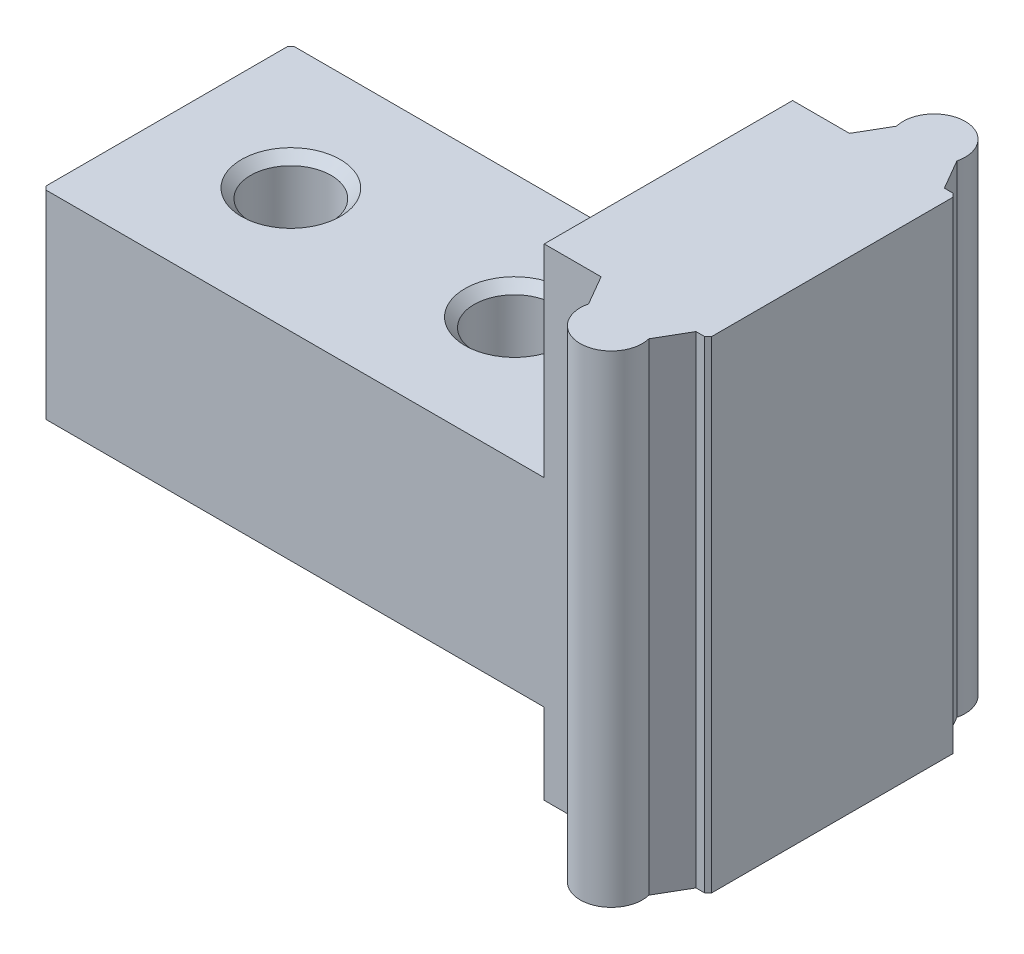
ISO-10303-21;
HEADER;
FILE_DESCRIPTION(('STEP AP214'),'2;1');
FILE_NAME('part.step','',(''),(''),'','','');
FILE_SCHEMA(('AUTOMOTIVE_DESIGN { 1 0 10303 214 1 1 1 1 }'));
ENDSEC;
DATA;
#1=APPLICATION_CONTEXT('core data for automotive mechanical design processes');
#2=APPLICATION_PROTOCOL_DEFINITION('international standard','automotive_design',2000,#1);
#3=PRODUCT_CONTEXT('',#1,'mechanical');
#4=PRODUCT('Part','Part','',(#3));
#5=PRODUCT_RELATED_PRODUCT_CATEGORY('part','',(#4));
#6=PRODUCT_DEFINITION_FORMATION('','',#4);
#7=PRODUCT_DEFINITION_CONTEXT('part definition',#1,'design');
#8=PRODUCT_DEFINITION('design','',#6,#7);
#9=PRODUCT_DEFINITION_SHAPE('','',#8);
#10=(LENGTH_UNIT() NAMED_UNIT(*) SI_UNIT(.MILLI.,.METRE.));
#11=(NAMED_UNIT(*) PLANE_ANGLE_UNIT() SI_UNIT($,.RADIAN.));
#12=(NAMED_UNIT(*) SI_UNIT($,.STERADIAN.) SOLID_ANGLE_UNIT());
#13=UNCERTAINTY_MEASURE_WITH_UNIT(LENGTH_MEASURE(1.E-05),#10,'distance_accuracy_value','');
#14=(GEOMETRIC_REPRESENTATION_CONTEXT(3) GLOBAL_UNCERTAINTY_ASSIGNED_CONTEXT((#13)) GLOBAL_UNIT_ASSIGNED_CONTEXT((#10,
#11,#12)) REPRESENTATION_CONTEXT('',''));
#15=CARTESIAN_POINT('',(0.,0.,0.));
#16=DIRECTION('',(0.,0.,1.));
#17=DIRECTION('',(1.,0.,0.));
#18=AXIS2_PLACEMENT_3D('',#15,#16,#17);
#19=CARTESIAN_POINT('',(-64.3,-24.4,-5.));
#20=DIRECTION('',(-1.,0.,0.));
#21=DIRECTION('',(0.,0.,1.));
#22=AXIS2_PLACEMENT_3D('',#19,#20,#21);
#23=PLANE('',#22);
#24=DIRECTION('',(0.,1.,0.));
#25=VECTOR('',#24,1.);
#26=CARTESIAN_POINT('',(-64.3,-24.4,5.));
#27=LINE('',#26,#25);
#28=CARTESIAN_POINT('',(-64.3,-24.4,5.));
#29=VERTEX_POINT('',#28);
#30=CARTESIAN_POINT('',(-64.3,-21.15,5.));
#31=VERTEX_POINT('',#30);
#32=EDGE_CURVE('E316',#29,#31,#27,.T.);
#33=ORIENTED_EDGE('',*,*,#32,.T.);
#34=DIRECTION('',(0.,0.,-1.));
#35=VECTOR('',#34,1.);
#36=CARTESIAN_POINT('',(-64.3,-21.15,-5.));
#37=LINE('',#36,#35);
#38=CARTESIAN_POINT('',(-64.3,-21.15,-5.));
#39=VERTEX_POINT('',#38);
#40=EDGE_CURVE('E33',#31,#39,#37,.T.);
#41=ORIENTED_EDGE('',*,*,#40,.T.);
#42=DIRECTION('',(0.,1.,0.));
#43=VECTOR('',#42,1.);
#44=CARTESIAN_POINT('',(-64.3,-24.4,-5.));
#45=LINE('',#44,#43);
#46=CARTESIAN_POINT('',(-64.3,-24.4,-5.));
#47=VERTEX_POINT('',#46);
#48=EDGE_CURVE('E11',#47,#39,#45,.T.);
#49=ORIENTED_EDGE('',*,*,#48,.F.);
#50=DIRECTION('',(0.,0.,1.));
#51=VECTOR('',#50,1.);
#52=CARTESIAN_POINT('',(-64.3,-24.4,-5.));
#53=LINE('',#52,#51);
#54=EDGE_CURVE('E208',#47,#29,#53,.T.);
#55=ORIENTED_EDGE('',*,*,#54,.T.);
#56=EDGE_LOOP('',(#33,#41,#49,#55));
#57=FACE_BOUND('',#56,.T.);
#58=ADVANCED_FACE('F16',(#57),#23,.T.);
#59=DIRECTION('',(0.,0.,-1.));
#60=VECTOR('',#59,1.);
#61=CARTESIAN_POINT('',(-64.3,-13.15,-5.));
#62=LINE('',#61,#60);
#63=CARTESIAN_POINT('',(-64.3,-13.15,5.));
#64=VERTEX_POINT('',#63);
#65=CARTESIAN_POINT('',(-64.3,-13.15,-5.));
#66=VERTEX_POINT('',#65);
#67=EDGE_CURVE('E40',#64,#66,#62,.T.);
#68=ORIENTED_EDGE('',*,*,#67,.F.);
#69=CARTESIAN_POINT('',(-64.3,-5.,5.));
#70=VERTEX_POINT('',#69);
#71=EDGE_CURVE('E251',#64,#70,#27,.T.);
#72=ORIENTED_EDGE('',*,*,#71,.T.);
#73=DIRECTION('',(0.,0.,1.));
#74=VECTOR('',#73,1.);
#75=CARTESIAN_POINT('',(-64.3,-5.,-5.));
#76=LINE('',#75,#74);
#77=CARTESIAN_POINT('',(-64.3,-5.,-5.));
#78=VERTEX_POINT('',#77);
#79=EDGE_CURVE('E207',#78,#70,#76,.T.);
#80=ORIENTED_EDGE('',*,*,#79,.F.);
#81=EDGE_CURVE('E25',#66,#78,#45,.T.);
#82=ORIENTED_EDGE('',*,*,#81,.F.);
#83=EDGE_LOOP('',(#68,#72,#80,#82));
#84=FACE_BOUND('',#83,.T.);
#85=ADVANCED_FACE('F18',(#84),#23,.T.);
#86=CARTESIAN_POINT('',(-62.01,-24.4,-5.));
#87=DIRECTION('',(0.,0.,-1.));
#88=DIRECTION('',(-1.,0.,0.));
#89=AXIS2_PLACEMENT_3D('',#86,#87,#88);
#90=PLANE('',#89);
#91=ORIENTED_EDGE('',*,*,#48,.T.);
#92=DIRECTION('',(-1.,0.,0.));
#93=VECTOR('',#92,1.);
#94=CARTESIAN_POINT('',(-64.1,-21.15,-5.));
#95=LINE('',#94,#93);
#96=CARTESIAN_POINT('',(-84.3585786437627,-21.15,-5.));
#97=VERTEX_POINT('',#96);
#98=EDGE_CURVE('E189',#39,#97,#95,.T.);
#99=ORIENTED_EDGE('',*,*,#98,.T.);
#100=DIRECTION('',(0.,1.,0.));
#101=VECTOR('',#100,1.);
#102=CARTESIAN_POINT('',(-84.3585786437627,-21.15,-5.));
#103=LINE('',#102,#101);
#104=CARTESIAN_POINT('',(-84.3585786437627,-13.15,-5.));
#105=VERTEX_POINT('',#104);
#106=EDGE_CURVE('E201',#97,#105,#103,.T.);
#107=ORIENTED_EDGE('',*,*,#106,.T.);
#108=DIRECTION('',(-1.,0.,0.));
#109=VECTOR('',#108,1.);
#110=CARTESIAN_POINT('',(-64.1,-13.15,-5.));
#111=LINE('',#110,#109);
#112=EDGE_CURVE('E182',#66,#105,#111,.T.);
#113=ORIENTED_EDGE('',*,*,#112,.F.);
#114=ORIENTED_EDGE('',*,*,#81,.T.);
#115=DIRECTION('',(-1.,0.,0.));
#116=VECTOR('',#115,1.);
#117=CARTESIAN_POINT('',(-62.01,-5.,-5.));
#118=LINE('',#117,#116);
#119=CARTESIAN_POINT('',(-62.01,-5.,-5.));
#120=VERTEX_POINT('',#119);
#121=EDGE_CURVE('E212',#120,#78,#118,.T.);
#122=ORIENTED_EDGE('',*,*,#121,.F.);
#123=DIRECTION('',(0.,1.,0.));
#124=VECTOR('',#123,1.);
#125=CARTESIAN_POINT('',(-62.01,-24.4,-5.));
#126=LINE('',#125,#124);
#127=CARTESIAN_POINT('',(-62.01,-24.4,-5.));
#128=VERTEX_POINT('',#127);
#129=EDGE_CURVE('E292',#128,#120,#126,.T.);
#130=ORIENTED_EDGE('',*,*,#129,.F.);
#131=DIRECTION('',(-1.,0.,0.));
#132=VECTOR('',#131,1.);
#133=CARTESIAN_POINT('',(-62.01,-24.4,-5.));
#134=LINE('',#133,#132);
#135=EDGE_CURVE('E248',#128,#47,#134,.T.);
#136=ORIENTED_EDGE('',*,*,#135,.T.);
#137=EDGE_LOOP('',(#91,#99,#107,#113,#114,#122,#130,#136));
#138=FACE_BOUND('',#137,.T.);
#139=ADVANCED_FACE('F365',(#138),#90,.T.);
#140=CARTESIAN_POINT('',(-61.3136310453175,-24.4,-6.20066793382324));
#141=DIRECTION('',(-0.865036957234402,0.,-0.501708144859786));
#142=DIRECTION('',(-0.501708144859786,0.,0.865036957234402));
#143=AXIS2_PLACEMENT_3D('',#140,#141,#142);
#144=PLANE('',#143);
#145=DIRECTION('',(-0.501708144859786,0.,0.865036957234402));
#146=VECTOR('',#145,1.);
#147=CARTESIAN_POINT('',(-61.3136310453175,-5.,-6.20066793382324));
#148=LINE('',#147,#146);
#149=CARTESIAN_POINT('',(-61.3136310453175,-5.,-6.20066793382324));
#150=VERTEX_POINT('',#149);
#151=EDGE_CURVE('E287',#150,#120,#148,.T.);
#152=ORIENTED_EDGE('',*,*,#151,.F.);
#153=DIRECTION('',(0.,1.,0.));
#154=VECTOR('',#153,1.);
#155=CARTESIAN_POINT('',(-61.3136310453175,-24.4,-6.20066793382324));
#156=LINE('',#155,#154);
#157=CARTESIAN_POINT('',(-61.3136310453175,-24.4,-6.20066793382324));
#158=VERTEX_POINT('',#157);
#159=EDGE_CURVE('E294',#158,#150,#156,.T.);
#160=ORIENTED_EDGE('',*,*,#159,.F.);
#161=DIRECTION('',(-0.501708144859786,0.,0.865036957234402));
#162=VECTOR('',#161,1.);
#163=CARTESIAN_POINT('',(-61.3136310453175,-24.4,-6.20066793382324));
#164=LINE('',#163,#162);
#165=EDGE_CURVE('E245',#158,#128,#164,.T.);
#166=ORIENTED_EDGE('',*,*,#165,.T.);
#167=ORIENTED_EDGE('',*,*,#129,.T.);
#168=EDGE_LOOP('',(#152,#160,#166,#167));
#169=FACE_BOUND('',#168,.T.);
#170=ADVANCED_FACE('F397',(#169),#144,.T.);
#171=CARTESIAN_POINT('',(-60.1,-24.4,-6.5));
#172=DIRECTION('',(0.,1.,0.));
#173=DIRECTION('',(0.,0.,1.));
#174=AXIS2_PLACEMENT_3D('',#171,#172,#173);
#175=CYLINDRICAL_SURFACE('',#174,1.25);
#176=CARTESIAN_POINT('',(-60.1,-5.,-6.5));
#177=DIRECTION('',(0.,1.,0.));
#178=DIRECTION('',(0.,0.,1.));
#179=AXIS2_PLACEMENT_3D('',#176,#177,#178);
#180=CIRCLE('',#179,1.25);
#181=CARTESIAN_POINT('',(-58.8863689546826,-5.,-6.20066793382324));
#182=VERTEX_POINT('',#181);
#183=EDGE_CURVE('E284',#182,#150,#180,.T.);
#184=ORIENTED_EDGE('',*,*,#183,.F.);
#185=DIRECTION('',(0.,1.,0.));
#186=VECTOR('',#185,1.);
#187=CARTESIAN_POINT('',(-58.8863689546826,-24.4,-6.20066793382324));
#188=LINE('',#187,#186);
#189=CARTESIAN_POINT('',(-58.8863689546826,-24.4,-6.20066793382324));
#190=VERTEX_POINT('',#189);
#191=EDGE_CURVE('E296',#190,#182,#188,.T.);
#192=ORIENTED_EDGE('',*,*,#191,.F.);
#193=CARTESIAN_POINT('',(-60.1,-24.4,-6.5));
#194=DIRECTION('',(0.,1.,0.));
#195=DIRECTION('',(0.,0.,1.));
#196=AXIS2_PLACEMENT_3D('',#193,#194,#195);
#197=CIRCLE('',#196,1.25);
#198=EDGE_CURVE('E242',#190,#158,#197,.T.);
#199=ORIENTED_EDGE('',*,*,#198,.T.);
#200=ORIENTED_EDGE('',*,*,#159,.T.);
#201=EDGE_LOOP('',(#184,#192,#199,#200));
#202=FACE_BOUND('',#201,.T.);
#203=ADVANCED_FACE('F402',(#202),#175,.T.);
#204=CARTESIAN_POINT('',(-58.19,-24.4,-5.));
#205=DIRECTION('',(0.865036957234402,0.,-0.501708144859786));
#206=DIRECTION('',(-0.501708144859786,0.,-0.865036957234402));
#207=AXIS2_PLACEMENT_3D('',#204,#205,#206);
#208=PLANE('',#207);
#209=DIRECTION('',(-0.501708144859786,0.,-0.865036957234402));
#210=VECTOR('',#209,1.);
#211=CARTESIAN_POINT('',(-58.19,-5.,-5.));
#212=LINE('',#211,#210);
#213=CARTESIAN_POINT('',(-58.19,-5.,-5.));
#214=VERTEX_POINT('',#213);
#215=EDGE_CURVE('E281',#214,#182,#212,.T.);
#216=ORIENTED_EDGE('',*,*,#215,.F.);
#217=DIRECTION('',(0.,1.,0.));
#218=VECTOR('',#217,1.);
#219=CARTESIAN_POINT('',(-58.19,-24.4,-5.));
#220=LINE('',#219,#218);
#221=CARTESIAN_POINT('',(-58.19,-24.4,-5.));
#222=VERTEX_POINT('',#221);
#223=EDGE_CURVE('E298',#222,#214,#220,.T.);
#224=ORIENTED_EDGE('',*,*,#223,.F.);
#225=DIRECTION('',(-0.501708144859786,0.,-0.865036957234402));
#226=VECTOR('',#225,1.);
#227=CARTESIAN_POINT('',(-58.19,-24.4,-5.));
#228=LINE('',#227,#226);
#229=EDGE_CURVE('E239',#222,#190,#228,.T.);
#230=ORIENTED_EDGE('',*,*,#229,.T.);
#231=ORIENTED_EDGE('',*,*,#191,.T.);
#232=EDGE_LOOP('',(#216,#224,#230,#231));
#233=FACE_BOUND('',#232,.T.);
#234=ADVANCED_FACE('F405',(#233),#208,.T.);
#235=CARTESIAN_POINT('',(-57.8414213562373,-24.4,-5.));
#236=DIRECTION('',(0.,0.,-1.));
#237=DIRECTION('',(-1.,0.,0.));
#238=AXIS2_PLACEMENT_3D('',#235,#236,#237);
#239=PLANE('',#238);
#240=DIRECTION('',(-1.,0.,0.));
#241=VECTOR('',#240,1.);
#242=CARTESIAN_POINT('',(-57.8414213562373,-5.,-5.));
#243=LINE('',#242,#241);
#244=CARTESIAN_POINT('',(-57.8414213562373,-5.,-5.));
#245=VERTEX_POINT('',#244);
#246=EDGE_CURVE('E278',#245,#214,#243,.T.);
#247=ORIENTED_EDGE('',*,*,#246,.F.);
#248=DIRECTION('',(0.,1.,0.));
#249=VECTOR('',#248,1.);
#250=CARTESIAN_POINT('',(-57.8414213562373,-24.4,-5.));
#251=LINE('',#250,#249);
#252=CARTESIAN_POINT('',(-57.8414213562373,-24.4,-5.));
#253=VERTEX_POINT('',#252);
#254=EDGE_CURVE('E300',#253,#245,#251,.T.);
#255=ORIENTED_EDGE('',*,*,#254,.F.);
#256=DIRECTION('',(-1.,0.,0.));
#257=VECTOR('',#256,1.);
#258=CARTESIAN_POINT('',(-57.8414213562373,-24.4,-5.));
#259=LINE('',#258,#257);
#260=EDGE_CURVE('E236',#253,#222,#259,.T.);
#261=ORIENTED_EDGE('',*,*,#260,.T.);
#262=ORIENTED_EDGE('',*,*,#223,.T.);
#263=EDGE_LOOP('',(#247,#255,#261,#262));
#264=FACE_BOUND('',#263,.T.);
#265=ADVANCED_FACE('F410',(#264),#239,.T.);
#266=CARTESIAN_POINT('',(-57.7,-24.4,-4.85857864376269));
#267=DIRECTION('',(0.707106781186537,0.,-0.707106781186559));
#268=DIRECTION('',(-0.707106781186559,0.,-0.707106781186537));
#269=AXIS2_PLACEMENT_3D('',#266,#267,#268);
#270=PLANE('',#269);
#271=DIRECTION('',(-0.707106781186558,0.,-0.707106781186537));
#272=VECTOR('',#271,1.);
#273=CARTESIAN_POINT('',(-57.7,-5.,-4.85857864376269));
#274=LINE('',#273,#272);
#275=CARTESIAN_POINT('',(-57.7,-5.,-4.85857864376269));
#276=VERTEX_POINT('',#275);
#277=EDGE_CURVE('E275',#276,#245,#274,.T.);
#278=ORIENTED_EDGE('',*,*,#277,.F.);
#279=DIRECTION('',(0.,1.,0.));
#280=VECTOR('',#279,1.);
#281=CARTESIAN_POINT('',(-57.7,-24.4,-4.85857864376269));
#282=LINE('',#281,#280);
#283=CARTESIAN_POINT('',(-57.7,-24.4,-4.85857864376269));
#284=VERTEX_POINT('',#283);
#285=EDGE_CURVE('E302',#284,#276,#282,.T.);
#286=ORIENTED_EDGE('',*,*,#285,.F.);
#287=DIRECTION('',(-0.707106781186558,0.,-0.707106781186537));
#288=VECTOR('',#287,1.);
#289=CARTESIAN_POINT('',(-57.7,-24.4,-4.85857864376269));
#290=LINE('',#289,#288);
#291=EDGE_CURVE('E233',#284,#253,#290,.T.);
#292=ORIENTED_EDGE('',*,*,#291,.T.);
#293=ORIENTED_EDGE('',*,*,#254,.T.);
#294=EDGE_LOOP('',(#278,#286,#292,#293));
#295=FACE_BOUND('',#294,.T.);
#296=ADVANCED_FACE('F413',(#295),#270,.T.);
#297=CARTESIAN_POINT('',(-57.7,-24.4,4.85857864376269));
#298=DIRECTION('',(1.,0.,0.));
#299=DIRECTION('',(0.,0.,-1.));
#300=AXIS2_PLACEMENT_3D('',#297,#298,#299);
#301=PLANE('',#300);
#302=DIRECTION('',(0.,0.,-1.));
#303=VECTOR('',#302,1.);
#304=CARTESIAN_POINT('',(-57.7,-5.,4.85857864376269));
#305=LINE('',#304,#303);
#306=CARTESIAN_POINT('',(-57.7,-5.,4.85857864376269));
#307=VERTEX_POINT('',#306);
#308=EDGE_CURVE('E272',#307,#276,#305,.T.);
#309=ORIENTED_EDGE('',*,*,#308,.F.);
#310=DIRECTION('',(0.,1.,0.));
#311=VECTOR('',#310,1.);
#312=CARTESIAN_POINT('',(-57.7,-24.4,4.85857864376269));
#313=LINE('',#312,#311);
#314=CARTESIAN_POINT('',(-57.7,-24.4,4.85857864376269));
#315=VERTEX_POINT('',#314);
#316=EDGE_CURVE('E304',#315,#307,#313,.T.);
#317=ORIENTED_EDGE('',*,*,#316,.F.);
#318=DIRECTION('',(0.,0.,-1.));
#319=VECTOR('',#318,1.);
#320=CARTESIAN_POINT('',(-57.7,-24.4,4.85857864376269));
#321=LINE('',#320,#319);
#322=EDGE_CURVE('E230',#315,#284,#321,.T.);
#323=ORIENTED_EDGE('',*,*,#322,.T.);
#324=ORIENTED_EDGE('',*,*,#285,.T.);
#325=EDGE_LOOP('',(#309,#317,#323,#324));
#326=FACE_BOUND('',#325,.T.);
#327=ADVANCED_FACE('F418',(#326),#301,.T.);
#328=CARTESIAN_POINT('',(-57.8414213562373,-24.4,5.));
#329=DIRECTION('',(0.707106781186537,0.,0.707106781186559));
#330=DIRECTION('',(0.707106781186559,0.,-0.707106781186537));
#331=AXIS2_PLACEMENT_3D('',#328,#329,#330);
#332=PLANE('',#331);
#333=DIRECTION('',(0.707106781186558,0.,-0.707106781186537));
#334=VECTOR('',#333,1.);
#335=CARTESIAN_POINT('',(-57.8414213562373,-5.,5.));
#336=LINE('',#335,#334);
#337=CARTESIAN_POINT('',(-57.8414213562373,-5.,5.));
#338=VERTEX_POINT('',#337);
#339=EDGE_CURVE('E269',#338,#307,#336,.T.);
#340=ORIENTED_EDGE('',*,*,#339,.F.);
#341=DIRECTION('',(0.,1.,0.));
#342=VECTOR('',#341,1.);
#343=CARTESIAN_POINT('',(-57.8414213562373,-24.4,5.));
#344=LINE('',#343,#342);
#345=CARTESIAN_POINT('',(-57.8414213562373,-24.4,5.));
#346=VERTEX_POINT('',#345);
#347=EDGE_CURVE('E306',#346,#338,#344,.T.);
#348=ORIENTED_EDGE('',*,*,#347,.F.);
#349=DIRECTION('',(0.707106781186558,0.,-0.707106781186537));
#350=VECTOR('',#349,1.);
#351=CARTESIAN_POINT('',(-57.8414213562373,-24.4,5.));
#352=LINE('',#351,#350);
#353=EDGE_CURVE('E227',#346,#315,#352,.T.);
#354=ORIENTED_EDGE('',*,*,#353,.T.);
#355=ORIENTED_EDGE('',*,*,#316,.T.);
#356=EDGE_LOOP('',(#340,#348,#354,#355));
#357=FACE_BOUND('',#356,.T.);
#358=ADVANCED_FACE('F421',(#357),#332,.T.);
#359=CARTESIAN_POINT('',(-58.19,-24.4,5.));
#360=DIRECTION('',(0.,0.,1.));
#361=DIRECTION('',(1.,0.,0.));
#362=AXIS2_PLACEMENT_3D('',#359,#360,#361);
#363=PLANE('',#362);
#364=DIRECTION('',(1.,0.,0.));
#365=VECTOR('',#364,1.);
#366=CARTESIAN_POINT('',(-58.19,-5.,5.));
#367=LINE('',#366,#365);
#368=CARTESIAN_POINT('',(-58.19,-5.,5.));
#369=VERTEX_POINT('',#368);
#370=EDGE_CURVE('E266',#369,#338,#367,.T.);
#371=ORIENTED_EDGE('',*,*,#370,.F.);
#372=DIRECTION('',(0.,1.,0.));
#373=VECTOR('',#372,1.);
#374=CARTESIAN_POINT('',(-58.19,-24.4,5.));
#375=LINE('',#374,#373);
#376=CARTESIAN_POINT('',(-58.19,-24.4,5.));
#377=VERTEX_POINT('',#376);
#378=EDGE_CURVE('E308',#377,#369,#375,.T.);
#379=ORIENTED_EDGE('',*,*,#378,.F.);
#380=DIRECTION('',(1.,0.,0.));
#381=VECTOR('',#380,1.);
#382=CARTESIAN_POINT('',(-58.19,-24.4,5.));
#383=LINE('',#382,#381);
#384=EDGE_CURVE('E224',#377,#346,#383,.T.);
#385=ORIENTED_EDGE('',*,*,#384,.T.);
#386=ORIENTED_EDGE('',*,*,#347,.T.);
#387=EDGE_LOOP('',(#371,#379,#385,#386));
#388=FACE_BOUND('',#387,.T.);
#389=ADVANCED_FACE('F426',(#388),#363,.T.);
#390=CARTESIAN_POINT('',(-58.8863689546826,-24.4,6.20066793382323));
#391=DIRECTION('',(0.865036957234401,0.,0.501708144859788));
#392=DIRECTION('',(0.501708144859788,0.,-0.865036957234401));
#393=AXIS2_PLACEMENT_3D('',#390,#391,#392);
#394=PLANE('',#393);
#395=DIRECTION('',(0.501708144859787,0.,-0.865036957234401));
#396=VECTOR('',#395,1.);
#397=CARTESIAN_POINT('',(-58.8863689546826,-5.,6.20066793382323));
#398=LINE('',#397,#396);
#399=CARTESIAN_POINT('',(-58.8863689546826,-5.,6.20066793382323));
#400=VERTEX_POINT('',#399);
#401=EDGE_CURVE('E263',#400,#369,#398,.T.);
#402=ORIENTED_EDGE('',*,*,#401,.F.);
#403=DIRECTION('',(0.,1.,0.));
#404=VECTOR('',#403,1.);
#405=CARTESIAN_POINT('',(-58.8863689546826,-24.4,6.20066793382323));
#406=LINE('',#405,#404);
#407=CARTESIAN_POINT('',(-58.8863689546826,-24.4,6.20066793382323));
#408=VERTEX_POINT('',#407);
#409=EDGE_CURVE('E310',#408,#400,#406,.T.);
#410=ORIENTED_EDGE('',*,*,#409,.F.);
#411=DIRECTION('',(0.501708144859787,0.,-0.865036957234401));
#412=VECTOR('',#411,1.);
#413=CARTESIAN_POINT('',(-58.8863689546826,-24.4,6.20066793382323));
#414=LINE('',#413,#412);
#415=EDGE_CURVE('E221',#408,#377,#414,.T.);
#416=ORIENTED_EDGE('',*,*,#415,.T.);
#417=ORIENTED_EDGE('',*,*,#378,.T.);
#418=EDGE_LOOP('',(#402,#410,#416,#417));
#419=FACE_BOUND('',#418,.T.);
#420=ADVANCED_FACE('F429',(#419),#394,.T.);
#421=CARTESIAN_POINT('',(-60.1,-24.4,6.5));
#422=DIRECTION('',(0.,1.,0.));
#423=DIRECTION('',(0.,0.,1.));
#424=AXIS2_PLACEMENT_3D('',#421,#422,#423);
#425=CYLINDRICAL_SURFACE('',#424,1.25);
#426=CARTESIAN_POINT('',(-60.1,-5.,6.5));
#427=DIRECTION('',(0.,1.,0.));
#428=DIRECTION('',(0.,0.,1.));
#429=AXIS2_PLACEMENT_3D('',#426,#427,#428);
#430=CIRCLE('',#429,1.25);
#431=CARTESIAN_POINT('',(-61.3136310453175,-5.,6.20066793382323));
#432=VERTEX_POINT('',#431);
#433=EDGE_CURVE('E260',#432,#400,#430,.T.);
#434=ORIENTED_EDGE('',*,*,#433,.F.);
#435=DIRECTION('',(0.,1.,0.));
#436=VECTOR('',#435,1.);
#437=CARTESIAN_POINT('',(-61.3136310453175,-24.4,6.20066793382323));
#438=LINE('',#437,#436);
#439=CARTESIAN_POINT('',(-61.3136310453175,-24.4,6.20066793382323));
#440=VERTEX_POINT('',#439);
#441=EDGE_CURVE('E312',#440,#432,#438,.T.);
#442=ORIENTED_EDGE('',*,*,#441,.F.);
#443=CARTESIAN_POINT('',(-60.1,-24.4,6.5));
#444=DIRECTION('',(0.,1.,0.));
#445=DIRECTION('',(0.,0.,1.));
#446=AXIS2_PLACEMENT_3D('',#443,#444,#445);
#447=CIRCLE('',#446,1.25);
#448=EDGE_CURVE('E218',#440,#408,#447,.T.);
#449=ORIENTED_EDGE('',*,*,#448,.T.);
#450=ORIENTED_EDGE('',*,*,#409,.T.);
#451=EDGE_LOOP('',(#434,#442,#449,#450));
#452=FACE_BOUND('',#451,.T.);
#453=ADVANCED_FACE('F431',(#452),#425,.T.);
#454=CARTESIAN_POINT('',(-62.01,-24.4,5.));
#455=DIRECTION('',(-0.865036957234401,0.,0.501708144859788));
#456=DIRECTION('',(0.501708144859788,0.,0.865036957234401));
#457=AXIS2_PLACEMENT_3D('',#454,#455,#456);
#458=PLANE('',#457);
#459=DIRECTION('',(0.501708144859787,0.,0.865036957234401));
#460=VECTOR('',#459,1.);
#461=CARTESIAN_POINT('',(-62.01,-5.,5.));
#462=LINE('',#461,#460);
#463=CARTESIAN_POINT('',(-62.01,-5.,5.));
#464=VERTEX_POINT('',#463);
#465=EDGE_CURVE('E257',#464,#432,#462,.T.);
#466=ORIENTED_EDGE('',*,*,#465,.F.);
#467=DIRECTION('',(0.,1.,0.));
#468=VECTOR('',#467,1.);
#469=CARTESIAN_POINT('',(-62.01,-24.4,5.));
#470=LINE('',#469,#468);
#471=CARTESIAN_POINT('',(-62.01,-24.4,5.));
#472=VERTEX_POINT('',#471);
#473=EDGE_CURVE('E314',#472,#464,#470,.T.);
#474=ORIENTED_EDGE('',*,*,#473,.F.);
#475=DIRECTION('',(0.501708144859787,0.,0.865036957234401));
#476=VECTOR('',#475,1.);
#477=CARTESIAN_POINT('',(-62.01,-24.4,5.));
#478=LINE('',#477,#476);
#479=EDGE_CURVE('E215',#472,#440,#478,.T.);
#480=ORIENTED_EDGE('',*,*,#479,.T.);
#481=ORIENTED_EDGE('',*,*,#441,.T.);
#482=EDGE_LOOP('',(#466,#474,#480,#481));
#483=FACE_BOUND('',#482,.T.);
#484=ADVANCED_FACE('F389',(#483),#458,.T.);
#485=CARTESIAN_POINT('',(-64.3,-24.4,5.));
#486=DIRECTION('',(0.,0.,1.));
#487=DIRECTION('',(1.,0.,0.));
#488=AXIS2_PLACEMENT_3D('',#485,#486,#487);
#489=PLANE('',#488);
#490=ORIENTED_EDGE('',*,*,#71,.F.);
#491=DIRECTION('',(1.,0.,0.));
#492=VECTOR('',#491,1.);
#493=CARTESIAN_POINT('',(-84.3585786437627,-13.15,5.));
#494=LINE('',#493,#492);
#495=CARTESIAN_POINT('',(-84.3585786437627,-13.15,5.));
#496=VERTEX_POINT('',#495);
#497=EDGE_CURVE('E196',#496,#64,#494,.T.);
#498=ORIENTED_EDGE('',*,*,#497,.F.);
#499=DIRECTION('',(0.,1.,0.));
#500=VECTOR('',#499,1.);
#501=CARTESIAN_POINT('',(-84.3585786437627,-21.15,5.));
#502=LINE('',#501,#500);
#503=CARTESIAN_POINT('',(-84.3585786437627,-21.15,5.));
#504=VERTEX_POINT('',#503);
#505=EDGE_CURVE('E164',#504,#496,#502,.T.);
#506=ORIENTED_EDGE('',*,*,#505,.F.);
#507=DIRECTION('',(1.,0.,0.));
#508=VECTOR('',#507,1.);
#509=CARTESIAN_POINT('',(-84.3585786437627,-21.15,5.));
#510=LINE('',#509,#508);
#511=EDGE_CURVE('E175',#504,#31,#510,.T.);
#512=ORIENTED_EDGE('',*,*,#511,.T.);
#513=ORIENTED_EDGE('',*,*,#32,.F.);
#514=DIRECTION('',(1.,0.,0.));
#515=VECTOR('',#514,1.);
#516=CARTESIAN_POINT('',(-64.3,-24.4,5.));
#517=LINE('',#516,#515);
#518=EDGE_CURVE('E211',#29,#472,#517,.T.);
#519=ORIENTED_EDGE('',*,*,#518,.T.);
#520=ORIENTED_EDGE('',*,*,#473,.T.);
#521=DIRECTION('',(1.,0.,0.));
#522=VECTOR('',#521,1.);
#523=CARTESIAN_POINT('',(-64.3,-5.,5.));
#524=LINE('',#523,#522);
#525=EDGE_CURVE('E254',#70,#464,#524,.T.);
#526=ORIENTED_EDGE('',*,*,#525,.F.);
#527=EDGE_LOOP('',(#490,#498,#506,#512,#513,#519,#520,#526));
#528=FACE_BOUND('',#527,.T.);
#529=ADVANCED_FACE('F370',(#528),#489,.T.);
#530=CARTESIAN_POINT('',(-60.1,-24.4,6.5));
#531=DIRECTION('',(0.,1.,0.));
#532=DIRECTION('',(0.,0.,1.));
#533=AXIS2_PLACEMENT_3D('',#530,#531,#532);
#534=PLANE('',#533);
#535=ORIENTED_EDGE('',*,*,#54,.F.);
#536=ORIENTED_EDGE('',*,*,#135,.F.);
#537=ORIENTED_EDGE('',*,*,#165,.F.);
#538=ORIENTED_EDGE('',*,*,#198,.F.);
#539=ORIENTED_EDGE('',*,*,#229,.F.);
#540=ORIENTED_EDGE('',*,*,#260,.F.);
#541=ORIENTED_EDGE('',*,*,#291,.F.);
#542=ORIENTED_EDGE('',*,*,#322,.F.);
#543=ORIENTED_EDGE('',*,*,#353,.F.);
#544=ORIENTED_EDGE('',*,*,#384,.F.);
#545=ORIENTED_EDGE('',*,*,#415,.F.);
#546=ORIENTED_EDGE('',*,*,#448,.F.);
#547=ORIENTED_EDGE('',*,*,#479,.F.);
#548=ORIENTED_EDGE('',*,*,#518,.F.);
#549=EDGE_LOOP('',(#535,#536,#537,#538,#539,#540,#541,#542,#543,#544,#545,#546,#547,#548));
#550=FACE_BOUND('',#549,.T.);
#551=ADVANCED_FACE('F383',(#550),#534,.F.);
#552=CARTESIAN_POINT('',(-60.1,-5.,6.5));
#553=DIRECTION('',(0.,1.,0.));
#554=DIRECTION('',(0.,0.,1.));
#555=AXIS2_PLACEMENT_3D('',#552,#553,#554);
#556=PLANE('',#555);
#557=ORIENTED_EDGE('',*,*,#79,.T.);
#558=ORIENTED_EDGE('',*,*,#525,.T.);
#559=ORIENTED_EDGE('',*,*,#465,.T.);
#560=ORIENTED_EDGE('',*,*,#433,.T.);
#561=ORIENTED_EDGE('',*,*,#401,.T.);
#562=ORIENTED_EDGE('',*,*,#370,.T.);
#563=ORIENTED_EDGE('',*,*,#339,.T.);
#564=ORIENTED_EDGE('',*,*,#308,.T.);
#565=ORIENTED_EDGE('',*,*,#277,.T.);
#566=ORIENTED_EDGE('',*,*,#246,.T.);
#567=ORIENTED_EDGE('',*,*,#215,.T.);
#568=ORIENTED_EDGE('',*,*,#183,.T.);
#569=ORIENTED_EDGE('',*,*,#151,.T.);
#570=ORIENTED_EDGE('',*,*,#121,.T.);
#571=EDGE_LOOP('',(#557,#558,#559,#560,#561,#562,#563,#564,#565,#566,#567,#568,#569,#570));
#572=FACE_BOUND('',#571,.T.);
#573=ADVANCED_FACE('F392',(#572),#556,.T.);
#574=CARTESIAN_POINT('',(-84.5,-21.15,-4.85857864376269));
#575=DIRECTION('',(-1.,0.,0.));
#576=DIRECTION('',(0.,0.,1.));
#577=AXIS2_PLACEMENT_3D('',#574,#575,#576);
#578=PLANE('',#577);
#579=DIRECTION('',(0.,0.,1.));
#580=VECTOR('',#579,1.);
#581=CARTESIAN_POINT('',(-84.5,-13.15,-4.85857864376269));
#582=LINE('',#581,#580);
#583=CARTESIAN_POINT('',(-84.5,-13.15,-4.85857864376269));
#584=VERTEX_POINT('',#583);
#585=CARTESIAN_POINT('',(-84.5,-13.15,4.85857864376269));
#586=VERTEX_POINT('',#585);
#587=EDGE_CURVE('E192',#584,#586,#582,.T.);
#588=ORIENTED_EDGE('',*,*,#587,.F.);
#589=DIRECTION('',(0.,1.,0.));
#590=VECTOR('',#589,1.);
#591=CARTESIAN_POINT('',(-84.5,-21.15,-4.85857864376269));
#592=LINE('',#591,#590);
#593=CARTESIAN_POINT('',(-84.5,-21.15,-4.85857864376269));
#594=VERTEX_POINT('',#593);
#595=EDGE_CURVE('E178',#594,#584,#592,.T.);
#596=ORIENTED_EDGE('',*,*,#595,.F.);
#597=DIRECTION('',(0.,0.,1.));
#598=VECTOR('',#597,1.);
#599=CARTESIAN_POINT('',(-84.5,-21.15,-4.85857864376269));
#600=LINE('',#599,#598);
#601=CARTESIAN_POINT('',(-84.5,-21.15,4.85857864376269));
#602=VERTEX_POINT('',#601);
#603=EDGE_CURVE('E172',#594,#602,#600,.T.);
#604=ORIENTED_EDGE('',*,*,#603,.T.);
#605=DIRECTION('',(0.,1.,0.));
#606=VECTOR('',#605,1.);
#607=CARTESIAN_POINT('',(-84.5,-21.15,4.85857864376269));
#608=LINE('',#607,#606);
#609=EDGE_CURVE('E154',#602,#586,#608,.T.);
#610=ORIENTED_EDGE('',*,*,#609,.T.);
#611=EDGE_LOOP('',(#588,#596,#604,#610));
#612=FACE_BOUND('',#611,.T.);
#613=ADVANCED_FACE('F177',(#612),#578,.T.);
#614=CARTESIAN_POINT('',(-84.3585786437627,-21.15,-5.));
#615=DIRECTION('',(-0.70710678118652,0.,-0.707106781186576));
#616=DIRECTION('',(-0.707106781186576,0.,0.70710678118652));
#617=AXIS2_PLACEMENT_3D('',#614,#615,#616);
#618=PLANE('',#617);
#619=DIRECTION('',(-0.707106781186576,0.,0.707106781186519));
#620=VECTOR('',#619,1.);
#621=CARTESIAN_POINT('',(-84.3585786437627,-13.15,-5.));
#622=LINE('',#621,#620);
#623=EDGE_CURVE('E179',#105,#584,#622,.T.);
#624=ORIENTED_EDGE('',*,*,#623,.F.);
#625=ORIENTED_EDGE('',*,*,#106,.F.);
#626=DIRECTION('',(-0.707106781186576,0.,0.707106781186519));
#627=VECTOR('',#626,1.);
#628=CARTESIAN_POINT('',(-84.3585786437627,-21.15,-5.));
#629=LINE('',#628,#627);
#630=EDGE_CURVE('E165',#97,#594,#629,.T.);
#631=ORIENTED_EDGE('',*,*,#630,.T.);
#632=ORIENTED_EDGE('',*,*,#595,.T.);
#633=EDGE_LOOP('',(#624,#625,#631,#632));
#634=FACE_BOUND('',#633,.T.);
#635=ADVANCED_FACE('F379',(#634),#618,.T.);
#636=CARTESIAN_POINT('',(-84.5,-21.15,4.85857864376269));
#637=DIRECTION('',(-0.70710678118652,0.,0.707106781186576));
#638=DIRECTION('',(0.707106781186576,0.,0.70710678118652));
#639=AXIS2_PLACEMENT_3D('',#636,#637,#638);
#640=PLANE('',#639);
#641=DIRECTION('',(0.707106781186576,0.,0.707106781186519));
#642=VECTOR('',#641,1.);
#643=CARTESIAN_POINT('',(-84.5,-13.15,4.85857864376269));
#644=LINE('',#643,#642);
#645=EDGE_CURVE('E159',#586,#496,#644,.T.);
#646=ORIENTED_EDGE('',*,*,#645,.F.);
#647=ORIENTED_EDGE('',*,*,#609,.F.);
#648=DIRECTION('',(0.707106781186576,0.,0.707106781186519));
#649=VECTOR('',#648,1.);
#650=CARTESIAN_POINT('',(-84.5,-21.15,4.85857864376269));
#651=LINE('',#650,#649);
#652=EDGE_CURVE('E157',#602,#504,#651,.T.);
#653=ORIENTED_EDGE('',*,*,#652,.T.);
#654=ORIENTED_EDGE('',*,*,#505,.T.);
#655=EDGE_LOOP('',(#646,#647,#653,#654));
#656=FACE_BOUND('',#655,.T.);
#657=ADVANCED_FACE('F156',(#656),#640,.T.);
#658=CARTESIAN_POINT('',(0.,-21.15,0.));
#659=DIRECTION('',(0.,1.,0.));
#660=DIRECTION('',(0.,0.,1.));
#661=AXIS2_PLACEMENT_3D('',#658,#659,#660);
#662=PLANE('',#661);
#663=CARTESIAN_POINT('',(-70.5,-21.15,0.));
#664=DIRECTION('',(0.,-1.,0.));
#665=DIRECTION('',(0.,0.,-1.));
#666=AXIS2_PLACEMENT_3D('',#663,#664,#665);
#667=CIRCLE('',#666,2.);
#668=CARTESIAN_POINT('',(-70.5,-21.15,-2.));
#669=VERTEX_POINT('',#668);
#670=EDGE_CURVE('E331',#669,#669,#667,.T.);
#671=ORIENTED_EDGE('',*,*,#670,.F.);
#672=EDGE_LOOP('',(#671));
#673=FACE_BOUND('',#672,.T.);
#674=CARTESIAN_POINT('',(-79.5,-21.15,0.));
#675=DIRECTION('',(0.,-1.,0.));
#676=DIRECTION('',(0.,0.,-1.));
#677=AXIS2_PLACEMENT_3D('',#674,#675,#676);
#678=CIRCLE('',#677,2.);
#679=CARTESIAN_POINT('',(-79.5,-21.15,-2.));
#680=VERTEX_POINT('',#679);
#681=EDGE_CURVE('E185',#680,#680,#678,.T.);
#682=ORIENTED_EDGE('',*,*,#681,.F.);
#683=EDGE_LOOP('',(#682));
#684=FACE_BOUND('',#683,.T.);
#685=ORIENTED_EDGE('',*,*,#40,.F.);
#686=ORIENTED_EDGE('',*,*,#511,.F.);
#687=ORIENTED_EDGE('',*,*,#652,.F.);
#688=ORIENTED_EDGE('',*,*,#603,.F.);
#689=ORIENTED_EDGE('',*,*,#630,.F.);
#690=ORIENTED_EDGE('',*,*,#98,.F.);
#691=EDGE_LOOP('',(#685,#686,#687,#688,#689,#690));
#692=FACE_BOUND('',#691,.T.);
#693=ADVANCED_FACE('F170',(#673,#684,#692),#662,.F.);
#694=CARTESIAN_POINT('',(0.,-13.15,0.));
#695=DIRECTION('',(0.,1.,0.));
#696=DIRECTION('',(0.,0.,1.));
#697=AXIS2_PLACEMENT_3D('',#694,#695,#696);
#698=PLANE('',#697);
#699=CARTESIAN_POINT('',(-70.5,-13.15,0.));
#700=DIRECTION('',(0.,1.,0.));
#701=DIRECTION('',(0.,0.,1.));
#702=AXIS2_PLACEMENT_3D('',#699,#700,#701);
#703=CIRCLE('',#702,1.99);
#704=CARTESIAN_POINT('',(-70.5,-13.15,1.99));
#705=VERTEX_POINT('',#704);
#706=EDGE_CURVE('E20',#705,#705,#703,.F.);
#707=ORIENTED_EDGE('',*,*,#706,.T.);
#708=EDGE_LOOP('',(#707));
#709=FACE_BOUND('',#708,.T.);
#710=CARTESIAN_POINT('',(-79.5,-13.15,0.));
#711=DIRECTION('',(0.,1.,0.));
#712=DIRECTION('',(0.,0.,1.));
#713=AXIS2_PLACEMENT_3D('',#710,#711,#712);
#714=CIRCLE('',#713,1.99);
#715=CARTESIAN_POINT('',(-79.5,-13.15,1.99));
#716=VERTEX_POINT('',#715);
#717=EDGE_CURVE('E194',#716,#716,#714,.F.);
#718=ORIENTED_EDGE('',*,*,#717,.T.);
#719=EDGE_LOOP('',(#718));
#720=FACE_BOUND('',#719,.T.);
#721=ORIENTED_EDGE('',*,*,#497,.T.);
#722=ORIENTED_EDGE('',*,*,#67,.T.);
#723=ORIENTED_EDGE('',*,*,#112,.T.);
#724=ORIENTED_EDGE('',*,*,#623,.T.);
#725=ORIENTED_EDGE('',*,*,#587,.T.);
#726=ORIENTED_EDGE('',*,*,#645,.T.);
#727=EDGE_LOOP('',(#721,#722,#723,#724,#725,#726));
#728=FACE_BOUND('',#727,.T.);
#729=ADVANCED_FACE('F374',(#709,#720,#728),#698,.T.);
#730=CARTESIAN_POINT('',(-79.5,-20.771,0.));
#731=DIRECTION('',(0.,-1.,0.));
#732=DIRECTION('',(0.,0.,-1.));
#733=AXIS2_PLACEMENT_3D('',#730,#731,#732);
#734=CONICAL_SURFACE('',#733,1.621,0.785398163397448);
#735=ORIENTED_EDGE('',*,*,#681,.T.);
#736=EDGE_LOOP('',(#735));
#737=FACE_BOUND('',#736,.T.);
#738=CARTESIAN_POINT('',(-79.5,-20.771,0.));
#739=DIRECTION('',(0.,-1.,0.));
#740=DIRECTION('',(0.,0.,-1.));
#741=AXIS2_PLACEMENT_3D('',#738,#739,#740);
#742=CIRCLE('',#741,1.621);
#743=CARTESIAN_POINT('',(-79.5,-20.771,-1.621));
#744=VERTEX_POINT('',#743);
#745=EDGE_CURVE('E321',#744,#744,#742,.T.);
#746=ORIENTED_EDGE('',*,*,#745,.F.);
#747=EDGE_LOOP('',(#746));
#748=FACE_BOUND('',#747,.T.);
#749=ADVANCED_FACE('F562',(#737,#748),#734,.F.);
#750=CARTESIAN_POINT('',(-79.5,-13.14,0.));
#751=DIRECTION('',(0.,-1.,0.));
#752=DIRECTION('',(0.,0.,-1.));
#753=AXIS2_PLACEMENT_3D('',#750,#751,#752);
#754=CYLINDRICAL_SURFACE('',#753,1.621);
#755=ORIENTED_EDGE('',*,*,#745,.T.);
#756=EDGE_LOOP('',(#755));
#757=FACE_BOUND('',#756,.T.);
#758=CARTESIAN_POINT('',(-79.5,-13.519,0.));
#759=DIRECTION('',(0.,-1.,0.));
#760=DIRECTION('',(0.,0.,-1.));
#761=AXIS2_PLACEMENT_3D('',#758,#759,#760);
#762=CIRCLE('',#761,1.621);
#763=CARTESIAN_POINT('',(-79.5,-13.519,-1.621));
#764=VERTEX_POINT('',#763);
#765=EDGE_CURVE('E325',#764,#764,#762,.T.);
#766=ORIENTED_EDGE('',*,*,#765,.F.);
#767=EDGE_LOOP('',(#766));
#768=FACE_BOUND('',#767,.T.);
#769=ADVANCED_FACE('F572',(#757,#768),#754,.F.);
#770=CARTESIAN_POINT('',(-79.5,-13.14,0.));
#771=DIRECTION('',(0.,1.,0.));
#772=DIRECTION('',(0.,0.,1.));
#773=AXIS2_PLACEMENT_3D('',#770,#771,#772);
#774=CONICAL_SURFACE('',#773,2.,0.785398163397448);
#775=ORIENTED_EDGE('',*,*,#717,.F.);
#776=EDGE_LOOP('',(#775));
#777=FACE_BOUND('',#776,.T.);
#778=ORIENTED_EDGE('',*,*,#765,.T.);
#779=EDGE_LOOP('',(#778));
#780=FACE_BOUND('',#779,.T.);
#781=ADVANCED_FACE('F356',(#777,#780),#774,.F.);
#782=CARTESIAN_POINT('',(-70.5,-20.771,0.));
#783=DIRECTION('',(0.,-1.,0.));
#784=DIRECTION('',(0.,0.,-1.));
#785=AXIS2_PLACEMENT_3D('',#782,#783,#784);
#786=CONICAL_SURFACE('',#785,1.621,0.785398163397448);
#787=ORIENTED_EDGE('',*,*,#670,.T.);
#788=EDGE_LOOP('',(#787));
#789=FACE_BOUND('',#788,.T.);
#790=CARTESIAN_POINT('',(-70.5,-20.771,0.));
#791=DIRECTION('',(0.,-1.,0.));
#792=DIRECTION('',(0.,0.,-1.));
#793=AXIS2_PLACEMENT_3D('',#790,#791,#792);
#794=CIRCLE('',#793,1.621);
#795=CARTESIAN_POINT('',(-70.5,-20.771,-1.621));
#796=VERTEX_POINT('',#795);
#797=EDGE_CURVE('E334',#796,#796,#794,.T.);
#798=ORIENTED_EDGE('',*,*,#797,.F.);
#799=EDGE_LOOP('',(#798));
#800=FACE_BOUND('',#799,.T.);
#801=ADVANCED_FACE('F345',(#789,#800),#786,.F.);
#802=CARTESIAN_POINT('',(-70.5,-13.14,0.));
#803=DIRECTION('',(0.,-1.,0.));
#804=DIRECTION('',(0.,0.,-1.));
#805=AXIS2_PLACEMENT_3D('',#802,#803,#804);
#806=CYLINDRICAL_SURFACE('',#805,1.621);
#807=ORIENTED_EDGE('',*,*,#797,.T.);
#808=EDGE_LOOP('',(#807));
#809=FACE_BOUND('',#808,.T.);
#810=CARTESIAN_POINT('',(-70.5,-13.519,0.));
#811=DIRECTION('',(0.,-1.,0.));
#812=DIRECTION('',(0.,0.,-1.));
#813=AXIS2_PLACEMENT_3D('',#810,#811,#812);
#814=CIRCLE('',#813,1.621);
#815=CARTESIAN_POINT('',(-70.5,-13.519,-1.621));
#816=VERTEX_POINT('',#815);
#817=EDGE_CURVE('E337',#816,#816,#814,.T.);
#818=ORIENTED_EDGE('',*,*,#817,.F.);
#819=EDGE_LOOP('',(#818));
#820=FACE_BOUND('',#819,.T.);
#821=ADVANCED_FACE('F343',(#809,#820),#806,.F.);
#822=CARTESIAN_POINT('',(-70.5,-13.14,0.));
#823=DIRECTION('',(0.,1.,0.));
#824=DIRECTION('',(0.,0.,1.));
#825=AXIS2_PLACEMENT_3D('',#822,#823,#824);
#826=CONICAL_SURFACE('',#825,2.,0.785398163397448);
#827=ORIENTED_EDGE('',*,*,#706,.F.);
#828=EDGE_LOOP('',(#827));
#829=FACE_BOUND('',#828,.T.);
#830=ORIENTED_EDGE('',*,*,#817,.T.);
#831=EDGE_LOOP('',(#830));
#832=FACE_BOUND('',#831,.T.);
#833=ADVANCED_FACE('F341',(#829,#832),#826,.F.);
#834=CLOSED_SHELL('',(#58,#85,#139,#170,#203,#234,#265,#296,#327,#358,#389,#420,#453,#484,#529,
#551,#573,#613,#635,#657,#693,#729,#749,#769,#781,#801,#821,#833));
#835=MANIFOLD_SOLID_BREP('B1',#834);
#836=ADVANCED_BREP_SHAPE_REPRESENTATION('',(#18,#835),#14);
#837=SHAPE_DEFINITION_REPRESENTATION(#9,#836);
ENDSEC;
END-ISO-10303-21;
